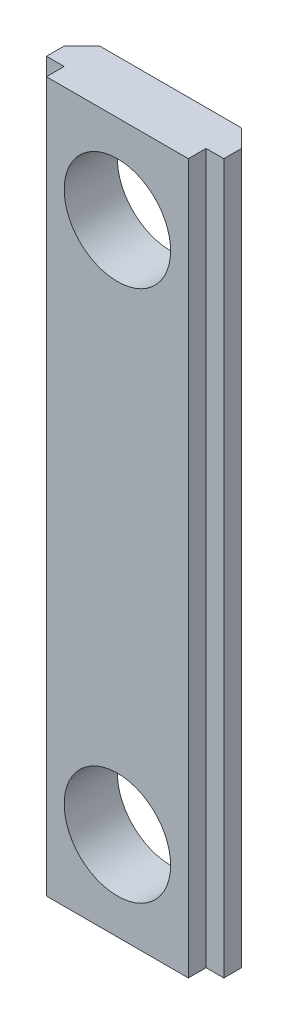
from build123d import *

# Parameters (mm, degrees)
EXTRUSION1_DEPTH = 40
EXTRUSION2_REACH = 43.11
ESQUISSE2_R      = 3


with BuildPart() as part:
    # Esquisse1 → Extrusion1 (new body)
    with BuildSketch(Plane(origin=(0, 0, 0), x_dir=(1, 0, 0), z_dir=(0, 1, 0))):
        Polygon((0, 0), (8, 0), (9, -0.999697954), (9, -2), (8, -2), (8, -3), (0, -3), (0, -2), (-1, -2), (-1, -0.999697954), align=None)
    extrude(amount=EXTRUSION1_DEPTH)

    # Esquisse2 → Extrusion2 (cut, up to next)
    with BuildSketch(Plane.XY.offset(3), mode=Mode.PRIVATE) as extrusion2_sk1:
        with Locations((4, 35)):
            Circle(ESQUISSE2_R)
    extrusion2_tool1 = extrude(extrusion2_sk1.sketch, amount=-EXTRUSION2_REACH, mode=Mode.PRIVATE) & part.part
    # Esquisse2 → Extrusion2 (cut, up to next)
    with BuildSketch(Plane.XY.offset(3), mode=Mode.PRIVATE) as extrusion2_sk2:
        with Locations((4, 5)):
            Circle(ESQUISSE2_R)
    extrusion2_tool2 = extrude(extrusion2_sk2.sketch, amount=-EXTRUSION2_REACH, mode=Mode.PRIVATE) & part.part
    add(extrusion2_tool1.solids().sort_by_distance((4, 35, 3))[0], mode=Mode.SUBTRACT)
    add(extrusion2_tool2.solids().sort_by_distance((4, 5, 3))[0], mode=Mode.SUBTRACT)


solid = part.part
